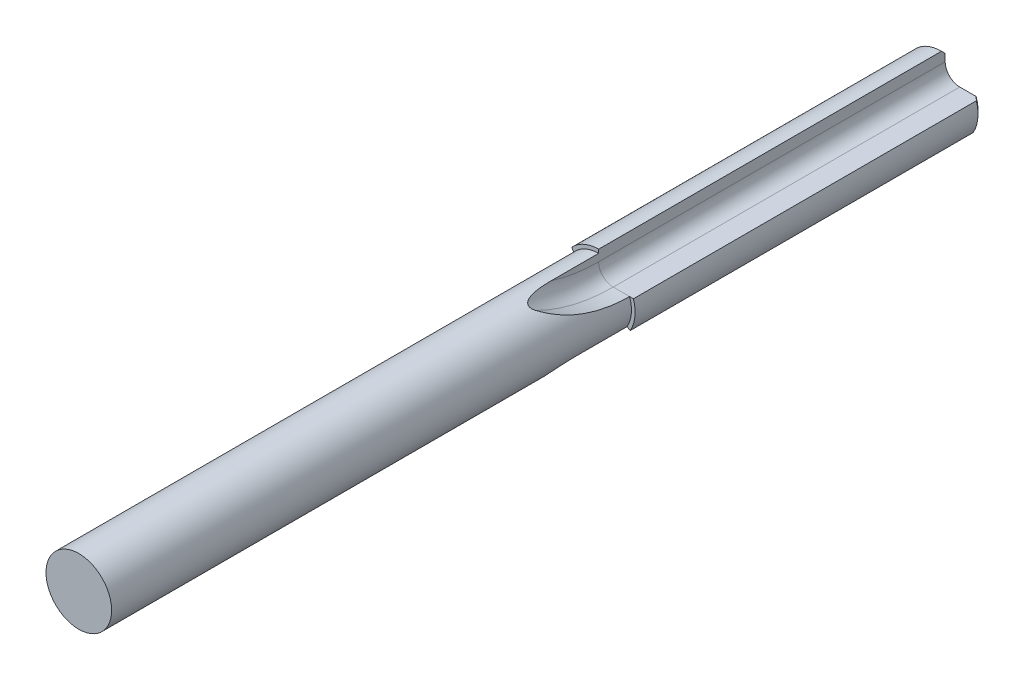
ISO-10303-21;
HEADER;
FILE_DESCRIPTION(('STEP AP214'),'2;1');
FILE_NAME('part.step','',(''),(''),'','','');
FILE_SCHEMA(('AUTOMOTIVE_DESIGN { 1 0 10303 214 1 1 1 1 }'));
ENDSEC;
DATA;
#1=APPLICATION_CONTEXT('core data for automotive mechanical design processes');
#2=APPLICATION_PROTOCOL_DEFINITION('international standard','automotive_design',2000,#1);
#3=PRODUCT_CONTEXT('',#1,'mechanical');
#4=PRODUCT('Part','Part','',(#3));
#5=PRODUCT_RELATED_PRODUCT_CATEGORY('part','',(#4));
#6=PRODUCT_DEFINITION_FORMATION('','',#4);
#7=PRODUCT_DEFINITION_CONTEXT('part definition',#1,'design');
#8=PRODUCT_DEFINITION('design','',#6,#7);
#9=PRODUCT_DEFINITION_SHAPE('','',#8);
#10=(LENGTH_UNIT() NAMED_UNIT(*) SI_UNIT(.MILLI.,.METRE.));
#11=(NAMED_UNIT(*) PLANE_ANGLE_UNIT() SI_UNIT($,.RADIAN.));
#12=(NAMED_UNIT(*) SI_UNIT($,.STERADIAN.) SOLID_ANGLE_UNIT());
#13=UNCERTAINTY_MEASURE_WITH_UNIT(LENGTH_MEASURE(1.E-05),#10,'distance_accuracy_value','');
#14=(GEOMETRIC_REPRESENTATION_CONTEXT(3) GLOBAL_UNCERTAINTY_ASSIGNED_CONTEXT((#13)) GLOBAL_UNIT_ASSIGNED_CONTEXT((#10,
#11,#12)) REPRESENTATION_CONTEXT('',''));
#15=CARTESIAN_POINT('',(0.,0.,0.));
#16=DIRECTION('',(0.,0.,1.));
#17=DIRECTION('',(1.,0.,0.));
#18=AXIS2_PLACEMENT_3D('',#15,#16,#17);
#19=CARTESIAN_POINT('',(0.,0.,11.6635805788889));
#20=DIRECTION('',(0.,0.,1.));
#21=DIRECTION('',(0.,-1.,0.));
#22=AXIS2_PLACEMENT_3D('',#19,#20,#21);
#23=CYLINDRICAL_SURFACE('',#22,0.449999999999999);
#24=CARTESIAN_POINT('',(0.,0.,11.875));
#25=DIRECTION('',(0.,0.,1.));
#26=DIRECTION('',(0.,-1.,0.));
#27=AXIS2_PLACEMENT_3D('',#24,#25,#26);
#28=CIRCLE('',#27,0.449999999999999);
#29=CARTESIAN_POINT('',(0.,-0.450000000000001,11.875));
#30=VERTEX_POINT('',#29);
#31=EDGE_CURVE('E324',#30,#30,#28,.T.);
#32=ORIENTED_EDGE('',*,*,#31,.F.);
#33=EDGE_LOOP('',(#32));
#34=FACE_BOUND('',#33,.T.);
#35=CARTESIAN_POINT('',(0.249106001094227,-0.374761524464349,5.81092621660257));
#36=CARTESIAN_POINT('',(0.236861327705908,-0.382880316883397,5.7980022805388));
#37=CARTESIAN_POINT('',(0.224907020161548,-0.389983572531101,5.78425280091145));
#38=CARTESIAN_POINT('',(0.201722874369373,-0.402472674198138,5.75552840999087));
#39=CARTESIAN_POINT('',(0.190490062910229,-0.407865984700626,5.74055919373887));
#40=CARTESIAN_POINT('',(0.168967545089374,-0.417234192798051,5.70996303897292));
#41=CARTESIAN_POINT('',(0.15866503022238,-0.421231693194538,5.69435165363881));
#42=CARTESIAN_POINT('',(0.138791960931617,-0.428191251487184,5.66242287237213));
#43=CARTESIAN_POINT('',(0.129222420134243,-0.431151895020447,5.64610454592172));
#44=CARTESIAN_POINT('',(0.105059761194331,-0.437840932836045,5.6025419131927));
#45=CARTESIAN_POINT('',(0.0910745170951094,-0.440888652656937,5.57485620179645));
#46=CARTESIAN_POINT('',(0.0649781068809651,-0.445478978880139,5.51851402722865));
#47=CARTESIAN_POINT('',(0.0528673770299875,-0.447021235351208,5.48985733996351));
#48=CARTESIAN_POINT('',(0.0188222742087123,-0.450199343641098,5.40194476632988));
#49=CARTESIAN_POINT('',(-0.000384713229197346,-0.450295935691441,5.34156881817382));
#50=CARTESIAN_POINT('',(-0.027897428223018,-0.449273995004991,5.23655461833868));
#51=CARTESIAN_POINT('',(-0.037749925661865,-0.448491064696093,5.19228945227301));
#52=CARTESIAN_POINT('',(-0.0544300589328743,-0.446775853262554,5.10316844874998));
#53=CARTESIAN_POINT('',(-0.0612563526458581,-0.445843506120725,5.05831235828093));
#54=CARTESIAN_POINT('',(-0.0718885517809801,-0.444253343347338,4.96959654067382));
#55=CARTESIAN_POINT('',(-0.0757781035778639,-0.443588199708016,4.92574676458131));
#56=CARTESIAN_POINT('',(-0.0809411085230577,-0.442661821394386,4.83793070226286));
#57=CARTESIAN_POINT('',(-0.0822170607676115,-0.442400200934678,4.79396456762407));
#58=CARTESIAN_POINT('',(-0.0822282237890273,-0.442423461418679,4.75000000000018));
#59=B_SPLINE_CURVE_WITH_KNOTS('',3,(#35,#36,#37,#38,#39,#40,#41,#42,#43,#44,#45,#46,#47,#48,#49,
#50,#51,#52,#53,#54,#55,#56,#57,#58),.UNSPECIFIED.,.F.,.F.,(4,2,2,2,2,2,2,2,2,2,2,4),(0.,
0.0585729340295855,0.116886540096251,0.174206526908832,0.231604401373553,0.324954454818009,
0.418326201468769,0.60785519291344,0.743835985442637,0.879877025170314,1.01187961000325,
1.14375591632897),.UNSPECIFIED.);
#60=CARTESIAN_POINT('',(0.249106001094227,-0.374761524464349,5.81092621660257));
#61=VERTEX_POINT('',#60);
#62=CARTESIAN_POINT('',(-0.0822282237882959,-0.442423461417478,4.75));
#63=VERTEX_POINT('',#62);
#64=EDGE_CURVE('E187',#61,#63,#59,.T.);
#65=ORIENTED_EDGE('',*,*,#64,.F.);
#66=CARTESIAN_POINT('',(0.37586699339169,-0.247434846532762,4.7498));
#67=CARTESIAN_POINT('',(0.375849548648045,-0.247458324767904,4.78317799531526));
#68=CARTESIAN_POINT('',(0.376113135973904,-0.247061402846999,4.81655101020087));
#69=CARTESIAN_POINT('',(0.377077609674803,-0.245588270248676,4.88326366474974));
#70=CARTESIAN_POINT('',(0.377778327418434,-0.244512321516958,4.91660331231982));
#71=CARTESIAN_POINT('',(0.37949266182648,-0.241842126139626,4.98325881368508));
#72=CARTESIAN_POINT('',(0.380506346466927,-0.240247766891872,5.01657466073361));
#73=CARTESIAN_POINT('',(0.382638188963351,-0.236837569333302,5.08319189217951));
#74=CARTESIAN_POINT('',(0.383756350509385,-0.235021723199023,5.11649327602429));
#75=CARTESIAN_POINT('',(0.385869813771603,-0.231535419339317,5.18310690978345));
#76=CARTESIAN_POINT('',(0.386865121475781,-0.229864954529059,5.21641915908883));
#77=CARTESIAN_POINT('',(0.388496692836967,-0.227096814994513,5.28308888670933));
#78=CARTESIAN_POINT('',(0.389132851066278,-0.22599930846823,5.31644637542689));
#79=CARTESIAN_POINT('',(0.389796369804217,-0.224854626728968,5.38328415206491));
#80=CARTESIAN_POINT('',(0.389822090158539,-0.224810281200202,5.41676452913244));
#81=CARTESIAN_POINT('',(0.38893577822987,-0.226339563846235,5.48365091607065));
#82=CARTESIAN_POINT('',(0.388024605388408,-0.227911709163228,5.51705696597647));
#83=CARTESIAN_POINT('',(0.384753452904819,-0.233406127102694,5.58403348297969));
#84=CARTESIAN_POINT('',(0.382377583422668,-0.237354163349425,5.61760169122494));
#85=CARTESIAN_POINT('',(0.376842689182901,-0.245966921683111,5.66717801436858));
#86=CARTESIAN_POINT('',(0.374678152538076,-0.249273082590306,5.68352863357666));
#87=CARTESIAN_POINT('',(0.36938942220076,-0.257050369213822,5.71578238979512));
#88=CARTESIAN_POINT('',(0.366267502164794,-0.261518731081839,5.73168649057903));
#89=CARTESIAN_POINT('',(0.360280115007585,-0.26964840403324,5.75546422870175));
#90=CARTESIAN_POINT('',(0.357956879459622,-0.272735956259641,5.76366757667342));
#91=CARTESIAN_POINT('',(0.352696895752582,-0.279506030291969,5.77963462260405));
#92=CARTESIAN_POINT('',(0.349760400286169,-0.283188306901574,5.78739849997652));
#93=CARTESIAN_POINT('',(0.344097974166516,-0.290016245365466,5.79980781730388));
#94=CARTESIAN_POINT('',(0.34159879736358,-0.292963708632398,5.80466334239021));
#95=CARTESIAN_POINT('',(0.336094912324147,-0.299261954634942,5.81379810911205));
#96=CARTESIAN_POINT('',(0.33309120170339,-0.302611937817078,5.81807845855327));
#97=CARTESIAN_POINT('',(0.327538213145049,-0.30859283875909,5.82450229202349));
#98=CARTESIAN_POINT('',(0.325152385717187,-0.311109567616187,5.82689073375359));
#99=CARTESIAN_POINT('',(0.320087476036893,-0.316318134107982,5.8311017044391));
#100=CARTESIAN_POINT('',(0.317408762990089,-0.319009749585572,5.83292493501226));
#101=CARTESIAN_POINT('',(0.311751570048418,-0.32454077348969,5.83587050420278));
#102=CARTESIAN_POINT('',(0.308770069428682,-0.327381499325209,5.83698476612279));
#103=CARTESIAN_POINT('',(0.30262429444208,-0.333070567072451,5.8383694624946));
#104=CARTESIAN_POINT('',(0.29946014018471,-0.335918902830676,5.83864044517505));
#105=CARTESIAN_POINT('',(0.293546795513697,-0.341091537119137,5.83837082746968));
#106=CARTESIAN_POINT('',(0.290804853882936,-0.343431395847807,5.83794349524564));
#107=CARTESIAN_POINT('',(0.285348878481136,-0.347977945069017,5.83655099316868));
#108=CARTESIAN_POINT('',(0.282634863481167,-0.35018455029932,5.83558548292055));
#109=CARTESIAN_POINT('',(0.275883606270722,-0.355549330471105,5.83258597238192));
#110=CARTESIAN_POINT('',(0.271895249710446,-0.358602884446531,5.83025730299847));
#111=CARTESIAN_POINT('',(0.264157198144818,-0.364340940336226,5.82486657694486));
#112=CARTESIAN_POINT('',(0.260408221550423,-0.367024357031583,5.82180243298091));
#113=CARTESIAN_POINT('',(0.250188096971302,-0.374126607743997,5.81246027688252));
#114=CARTESIAN_POINT('',(0.243995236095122,-0.378172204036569,5.80560176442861));
#115=CARTESIAN_POINT('',(0.232272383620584,-0.385482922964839,5.79097795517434));
#116=CARTESIAN_POINT('',(0.226744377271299,-0.388745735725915,5.78321007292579));
#117=CARTESIAN_POINT('',(0.21367962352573,-0.396133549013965,5.76324795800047));
#118=CARTESIAN_POINT('',(0.206458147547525,-0.399916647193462,5.75072414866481));
#119=CARTESIAN_POINT('',(0.192868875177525,-0.406642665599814,5.72499628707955));
#120=CARTESIAN_POINT('',(0.186502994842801,-0.409583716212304,5.71179079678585));
#121=CARTESIAN_POINT('',(0.168368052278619,-0.417527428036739,5.67143594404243));
#122=CARTESIAN_POINT('',(0.157623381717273,-0.421618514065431,5.64365331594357));
#123=CARTESIAN_POINT('',(0.131459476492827,-0.43071937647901,5.56839478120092));
#124=CARTESIAN_POINT('',(0.117742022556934,-0.434503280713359,5.52021486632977));
#125=CARTESIAN_POINT('',(0.0939780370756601,-0.440239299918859,5.42279117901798));
#126=CARTESIAN_POINT('',(0.0839404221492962,-0.44218698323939,5.37354512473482));
#127=CARTESIAN_POINT('',(0.0668154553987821,-0.44509688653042,5.27448271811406));
#128=CARTESIAN_POINT('',(0.0597305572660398,-0.446058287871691,5.22466592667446));
#129=CARTESIAN_POINT('',(0.0480324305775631,-0.447466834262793,5.12479548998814));
#130=CARTESIAN_POINT('',(0.0434167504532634,-0.447914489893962,5.07474212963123));
#131=CARTESIAN_POINT('',(0.036600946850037,-0.448521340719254,4.97875973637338));
#132=CARTESIAN_POINT('',(0.0342285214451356,-0.448701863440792,4.93284265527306));
#133=CARTESIAN_POINT('',(0.0311165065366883,-0.448922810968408,4.84121526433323));
#134=CARTESIAN_POINT('',(0.0303676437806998,-0.44896403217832,4.79550527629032));
#135=CARTESIAN_POINT('',(0.030350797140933,-0.44897531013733,4.7498));
#136=B_SPLINE_CURVE_WITH_KNOTS('',3,(#66,#67,#68,#69,#70,#71,#72,#73,#74,#75,#76,#77,#78,#79,
#80,#81,#82,#83,#84,#85,#86,#87,#88,#89,#90,#91,#92,#93,#94,#95,#96,#97,#98,#99,#100,#101,#102,
#103,#104,#105,#106,#107,#108,#109,#110,#111,#112,#113,#114,#115,#116,#117,#118,#119,#120,#121,
#122,#123,#124,#125,#126,#127,#128,#129,#130,#131,#132,#133,#134,#135),.UNSPECIFIED.,.F.,.F.,(4,
2,2,2,2,2,2,2,2,2,2,2,2,2,2,2,2,2,2,2,2,2,2,2,2,2,2,2,2,2,2,2,2,2,4),(0.,0.10012257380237,
0.200206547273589,0.300312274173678,0.400421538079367,0.500525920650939,0.600659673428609,
0.701062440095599,0.80137318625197,0.902791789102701,0.953214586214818,1.00351855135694,
1.03069035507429,1.05785098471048,1.07642777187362,1.09496825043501,1.10755952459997,
1.12013510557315,1.13285149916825,1.14555962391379,1.15640275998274,1.16725276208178,
1.18376707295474,1.20032881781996,1.23042102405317,1.26060096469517,1.30532032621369,
1.35013822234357,1.44014858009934,1.59056255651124,1.74133862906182,1.89223974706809,
2.04299076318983,2.18089761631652,2.31801469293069),.UNSPECIFIED.);
#137=CARTESIAN_POINT('',(0.389711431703,-0.224999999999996,5.39807406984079));
#138=VERTEX_POINT('',#137);
#139=EDGE_CURVE('E11',#138,#61,#136,.T.);
#140=ORIENTED_EDGE('',*,*,#139,.F.);
#141=DIRECTION('',(0.,0.,1.));
#142=VECTOR('',#141,1.);
#143=CARTESIAN_POINT('',(0.389711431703,-0.224999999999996,11.6635805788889));
#144=LINE('',#143,#142);
#145=CARTESIAN_POINT('',(0.389711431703,-0.224999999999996,4.75));
#146=VERTEX_POINT('',#145);
#147=EDGE_CURVE('E247',#138,#146,#144,.F.);
#148=ORIENTED_EDGE('',*,*,#147,.T.);
#149=CARTESIAN_POINT('',(0.,0.,4.75));
#150=DIRECTION('',(0.,0.,1.));
#151=DIRECTION('',(0.,-1.,0.));
#152=AXIS2_PLACEMENT_3D('',#149,#150,#151);
#153=CIRCLE('',#152,0.449999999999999);
#154=CARTESIAN_POINT('',(0.424264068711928,0.149999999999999,4.75));
#155=VERTEX_POINT('',#154);
#156=EDGE_CURVE('E329',#146,#155,#153,.T.);
#157=ORIENTED_EDGE('',*,*,#156,.T.);
#158=CARTESIAN_POINT('',(0.2,0.403112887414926,5.81092621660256));
#159=CARTESIAN_POINT('',(0.213153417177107,0.396568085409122,5.7980022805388));
#160=CARTESIAN_POINT('',(0.225282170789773,0.389766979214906,5.78425280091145));
#161=CARTESIAN_POINT('',(0.24769012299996,0.375933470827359,5.75552840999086));
#162=CARTESIAN_POINT('',(0.257977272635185,0.368902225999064,5.74055919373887));
#163=CARTESIAN_POINT('',(0.276851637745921,0.354947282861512,5.70996303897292));
#164=CARTESIAN_POINT('',(0.285464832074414,0.348023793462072,5.69435165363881));
#165=CARTESIAN_POINT('',(0.301428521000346,0.334292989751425,5.66242287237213));
#166=CARTESIAN_POINT('',(0.308777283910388,0.327485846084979,5.64610454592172));
#167=CARTESIAN_POINT('',(0.326651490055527,0.309904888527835,5.6025419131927));
#168=CARTESIAN_POINT('',(0.336283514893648,0.299317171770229,5.57485620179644));
#169=CARTESIAN_POINT('',(0.353307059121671,0.279012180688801,5.51851402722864));
#170=CARTESIAN_POINT('',(0.360698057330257,0.269295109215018,5.4898573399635));
#171=CARTESIAN_POINT('',(0.380472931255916,0.241400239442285,5.40194476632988));
#172=CARTESIAN_POINT('',(0.390160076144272,0.224814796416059,5.34156881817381));
#173=CARTESIAN_POINT('',(0.403031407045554,0.200477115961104,5.23655461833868));
#174=CARTESIAN_POINT('',(0.407279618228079,0.191553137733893,5.19228945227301));
#175=CARTESIAN_POINT('',(0.414134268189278,0.17625011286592,5.10316844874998));
#176=CARTESIAN_POINT('',(0.4167399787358,0.169872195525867,5.05831235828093));
#177=CARTESIAN_POINT('',(0.420678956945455,0.159869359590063,4.96959654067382));
#178=CARTESIAN_POINT('',(0.422047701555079,0.156168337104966,4.92574676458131));
#179=CARTESIAN_POINT('',(0.423826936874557,0.151233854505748,4.83793070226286));
#180=CARTESIAN_POINT('',(0.424238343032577,0.149998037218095,4.79396456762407));
#181=CARTESIAN_POINT('',(0.424264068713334,0.149999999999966,4.75000000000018));
#182=B_SPLINE_CURVE_WITH_KNOTS('',3,(#158,#159,#160,#161,#162,#163,#164,#165,#166,#167,#168,
#169,#170,#171,#172,#173,#174,#175,#176,#177,#178,#179,#180,#181),.UNSPECIFIED.,.F.,.F.,(4,2,2,
2,2,2,2,2,2,2,2,4),(0.,0.0585729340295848,0.116886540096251,0.174206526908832,0.231604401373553,
0.324954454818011,0.418326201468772,0.607855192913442,0.743835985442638,0.879877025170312,
1.01187961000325,1.14375591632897),.UNSPECIFIED.);
#183=CARTESIAN_POINT('',(0.2,0.403112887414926,5.81092621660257));
#184=VERTEX_POINT('',#183);
#185=EDGE_CURVE('E270',#184,#155,#182,.T.);
#186=ORIENTED_EDGE('',*,*,#185,.F.);
#187=CARTESIAN_POINT('',(0.0263513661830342,0.44922778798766,4.7498));
#188=CARTESIAN_POINT('',(0.0263802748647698,0.449224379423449,4.78314810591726));
#189=CARTESIAN_POINT('',(0.0259056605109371,0.449254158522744,4.81649123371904));
#190=CARTESIAN_POINT('',(0.0241508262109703,0.44935273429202,4.88314249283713));
#191=CARTESIAN_POINT('',(0.0228709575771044,0.449421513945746,4.91645063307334));
#192=CARTESIAN_POINT('',(0.0197034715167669,0.449570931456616,4.98310453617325));
#193=CARTESIAN_POINT('',(0.0178146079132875,0.44965159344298,5.0164502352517));
#194=CARTESIAN_POINT('',(0.0137924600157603,0.449793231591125,5.08312874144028));
#195=CARTESIAN_POINT('',(0.0116591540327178,0.449854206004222,5.11646154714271));
#196=CARTESIAN_POINT('',(0.00640610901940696,0.449964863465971,5.20228689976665));
#197=CARTESIAN_POINT('',(0.00342346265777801,0.449987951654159,5.25478913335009));
#198=CARTESIAN_POINT('',(-0.000135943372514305,0.450006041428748,5.35985775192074));
#199=CARTESIAN_POINT('',(-0.000715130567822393,0.450001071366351,5.41242401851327));
#200=CARTESIAN_POINT('',(0.0024123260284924,0.449996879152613,5.50214751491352));
#201=CARTESIAN_POINT('',(0.00491878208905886,0.449996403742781,5.53932948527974));
#202=CARTESIAN_POINT('',(0.0115311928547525,0.449856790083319,5.59482292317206));
#203=CARTESIAN_POINT('',(0.0142168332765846,0.449786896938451,5.61330107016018));
#204=CARTESIAN_POINT('',(0.0208298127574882,0.449530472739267,5.65002798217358));
#205=CARTESIAN_POINT('',(0.0247558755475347,0.449344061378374,5.6682769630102));
#206=CARTESIAN_POINT('',(0.034332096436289,0.448714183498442,5.7044931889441));
#207=CARTESIAN_POINT('',(0.0399980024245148,0.448268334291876,5.72245621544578));
#208=CARTESIAN_POINT('',(0.0538300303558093,0.44682732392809,5.75737325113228));
#209=CARTESIAN_POINT('',(0.0619770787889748,0.445836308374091,5.77433381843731));
#210=CARTESIAN_POINT('',(0.0759040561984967,0.443566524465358,5.79544632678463));
#211=CARTESIAN_POINT('',(0.0798547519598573,0.44287921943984,5.80084082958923));
#212=CARTESIAN_POINT('',(0.0884363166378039,0.441246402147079,5.81101861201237));
#213=CARTESIAN_POINT('',(0.0930654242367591,0.440301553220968,5.81580341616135));
#214=CARTESIAN_POINT('',(0.101281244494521,0.438466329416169,5.8228267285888));
#215=CARTESIAN_POINT('',(0.10463731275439,0.43768042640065,5.82535942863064));
#216=CARTESIAN_POINT('',(0.111665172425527,0.435940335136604,5.82987534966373));
#217=CARTESIAN_POINT('',(0.115336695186,0.434986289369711,5.83185903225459));
#218=CARTESIAN_POINT('',(0.122988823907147,0.432885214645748,5.83513506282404));
#219=CARTESIAN_POINT('',(0.126972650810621,0.431735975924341,5.83641869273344));
#220=CARTESIAN_POINT('',(0.135070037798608,0.429271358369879,5.83812393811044));
#221=CARTESIAN_POINT('',(0.139183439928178,0.427956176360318,5.8385465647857));
#222=CARTESIAN_POINT('',(0.146731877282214,0.425421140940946,5.83852210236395));
#223=CARTESIAN_POINT('',(0.150173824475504,0.424217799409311,5.83819893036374));
#224=CARTESIAN_POINT('',(0.156938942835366,0.421761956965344,5.8369909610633));
#225=CARTESIAN_POINT('',(0.16026201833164,0.420509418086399,5.83610572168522));
#226=CARTESIAN_POINT('',(0.168225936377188,0.417403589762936,5.83334679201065));
#227=CARTESIAN_POINT('',(0.172768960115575,0.415539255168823,5.83120564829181));
#228=CARTESIAN_POINT('',(0.181445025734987,0.411825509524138,5.82620221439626));
#229=CARTESIAN_POINT('',(0.185576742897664,0.409976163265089,5.8233376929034));
#230=CARTESIAN_POINT('',(0.193244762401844,0.406414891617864,5.81725652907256));
#231=CARTESIAN_POINT('',(0.196800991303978,0.404700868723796,5.81406649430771));
#232=CARTESIAN_POINT('',(0.200200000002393,0.403013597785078,5.81072972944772));
#233=B_SPLINE_CURVE_WITH_KNOTS('',3,(#187,#188,#189,#190,#191,#192,#193,#194,#195,#196,#197,
#198,#199,#200,#201,#202,#203,#204,#205,#206,#207,#208,#209,#210,#211,#212,#213,#214,#215,#216,
#217,#218,#219,#220,#221,#222,#223,#224,#225,#226,#227,#228,#229,#230,#231,#232),.UNSPECIFIED.,
.F.,.F.,(4,2,2,2,2,2,2,2,2,2,2,2,2,2,2,2,2,2,2,2,2,2,4),(0.,0.100032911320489,0.200022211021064,
0.300217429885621,0.400421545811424,0.558172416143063,0.715763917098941,0.827414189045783,
0.883403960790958,0.93933631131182,0.995790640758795,1.05182149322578,1.07194288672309,
1.09201293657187,1.10480569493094,1.1175876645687,1.13052537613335,1.14344788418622,
1.15438025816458,1.16532124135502,1.18130028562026,1.19732923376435,1.21251112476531),.UNSPECIFIED.);
#234=CARTESIAN_POINT('',(0.,0.449999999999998,5.39807406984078));
#235=VERTEX_POINT('',#234);
#236=EDGE_CURVE('E262',#235,#184,#233,.T.);
#237=ORIENTED_EDGE('',*,*,#236,.F.);
#238=DIRECTION('',(0.,0.,1.));
#239=VECTOR('',#238,1.);
#240=CARTESIAN_POINT('',(0.,0.449999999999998,11.6635805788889));
#241=LINE('',#240,#239);
#242=CARTESIAN_POINT('',(0.,0.449999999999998,4.75));
#243=VERTEX_POINT('',#242);
#244=EDGE_CURVE('E347',#235,#243,#241,.F.);
#245=ORIENTED_EDGE('',*,*,#244,.T.);
#246=CARTESIAN_POINT('',(-0.34203584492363,0.292423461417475,4.75));
#247=VERTEX_POINT('',#246);
#248=EDGE_CURVE('E330',#243,#247,#153,.T.);
#249=ORIENTED_EDGE('',*,*,#248,.T.);
#250=CARTESIAN_POINT('',(-0.449106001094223,-0.0283513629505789,5.81092621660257));
#251=CARTESIAN_POINT('',(-0.450014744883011,-0.0136877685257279,5.7980022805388));
#252=CARTESIAN_POINT('',(-0.450189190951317,0.000216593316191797,5.78425280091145));
#253=CARTESIAN_POINT('',(-0.44941299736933,0.0265392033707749,5.75552840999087));
#254=CARTESIAN_POINT('',(-0.448467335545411,0.0389637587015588,5.74055919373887));
#255=CARTESIAN_POINT('',(-0.445819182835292,0.0622869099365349,5.70996303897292));
#256=CARTESIAN_POINT('',(-0.444129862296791,0.0732078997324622,5.69435165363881));
#257=CARTESIAN_POINT('',(-0.440220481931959,0.0938982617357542,5.66242287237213));
#258=CARTESIAN_POINT('',(-0.437999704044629,0.103666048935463,5.64610454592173));
#259=CARTESIAN_POINT('',(-0.431711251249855,0.127936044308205,5.6025419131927));
#260=CARTESIAN_POINT('',(-0.427358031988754,0.141571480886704,5.57485620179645));
#261=CARTESIAN_POINT('',(-0.418285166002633,0.166466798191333,5.51851402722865));
#262=CARTESIAN_POINT('',(-0.413565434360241,0.177726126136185,5.48985733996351));
#263=CARTESIAN_POINT('',(-0.399295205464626,0.208799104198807,5.40194476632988));
#264=CARTESIAN_POINT('',(-0.389775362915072,0.225481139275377,5.34156881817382));
#265=CARTESIAN_POINT('',(-0.375133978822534,0.248796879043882,5.23655461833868));
#266=CARTESIAN_POINT('',(-0.369529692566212,0.256937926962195,5.19228945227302));
#267=CARTESIAN_POINT('',(-0.359704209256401,0.27052574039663,5.10316844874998));
#268=CARTESIAN_POINT('',(-0.35548362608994,0.275971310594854,5.05831235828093));
#269=CARTESIAN_POINT('',(-0.348790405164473,0.284383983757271,4.96959654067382));
#270=CARTESIAN_POINT('',(-0.346269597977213,0.287419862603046,4.92574676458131));
#271=CARTESIAN_POINT('',(-0.342885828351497,0.291427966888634,4.83793070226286));
#272=CARTESIAN_POINT('',(-0.342021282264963,0.292402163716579,4.79396456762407));
#273=CARTESIAN_POINT('',(-0.342035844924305,0.292423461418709,4.75000000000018));
#274=B_SPLINE_CURVE_WITH_KNOTS('',3,(#250,#251,#252,#253,#254,#255,#256,#257,#258,#259,#260,
#261,#262,#263,#264,#265,#266,#267,#268,#269,#270,#271,#272,#273),.UNSPECIFIED.,.F.,.F.,(4,2,2,
2,2,2,2,2,2,2,2,4),(0.,0.0585729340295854,0.116886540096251,0.174206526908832,0.231604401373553,
0.324954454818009,0.418326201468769,0.60785519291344,0.743835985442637,0.879877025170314,
1.01187961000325,1.14375591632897),.UNSPECIFIED.);
#275=CARTESIAN_POINT('',(-0.449106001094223,-0.028351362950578,5.81092621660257));
#276=VERTEX_POINT('',#275);
#277=EDGE_CURVE('E278',#276,#247,#274,.T.);
#278=ORIENTED_EDGE('',*,*,#277,.F.);
#279=CARTESIAN_POINT('',(-0.402218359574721,-0.201792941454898,4.7498));
#280=CARTESIAN_POINT('',(-0.402229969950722,-0.201766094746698,4.78317799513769));
#281=CARTESIAN_POINT('',(-0.402018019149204,-0.20219282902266,4.81655100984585));
#282=CARTESIAN_POINT('',(-0.401224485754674,-0.203764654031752,4.88326366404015));
#283=CARTESIAN_POINT('',(-0.400643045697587,-0.204909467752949,4.9166033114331));
#284=CARTESIAN_POINT('',(-0.399187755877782,-0.207729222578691,4.9832588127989));
#285=CARTESIAN_POINT('',(-0.398313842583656,-0.209404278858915,5.01657466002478));
#286=CARTESIAN_POINT('',(-0.396426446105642,-0.21295560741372,5.08319189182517));
#287=CARTESIAN_POINT('',(-0.395412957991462,-0.214831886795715,5.11649327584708));
#288=CARTESIAN_POINT('',(-0.393450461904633,-0.218405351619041,5.18310690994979));
#289=CARTESIAN_POINT('',(-0.392501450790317,-0.220102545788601,5.21641915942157));
#290=CARTESIAN_POINT('',(-0.39091995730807,-0.22289959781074,5.28308888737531));
#291=CARTESIAN_POINT('',(-0.390287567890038,-0.223999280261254,5.31644637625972));
#292=CARTESIAN_POINT('',(-0.389628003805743,-0.225146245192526,5.38328415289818));
#293=CARTESIAN_POINT('',(-0.389602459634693,-0.225190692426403,5.41676452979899));
#294=CARTESIAN_POINT('',(-0.390483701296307,-0.223658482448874,5.48365091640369));
#295=CARTESIAN_POINT('',(-0.39138963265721,-0.222083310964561,5.51705696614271));
#296=CARTESIAN_POINT('',(-0.394512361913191,-0.216503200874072,5.58403348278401));
#297=CARTESIAN_POINT('',(-0.39674352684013,-0.212471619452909,5.6176016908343));
#298=CARTESIAN_POINT('',(-0.401434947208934,-0.203371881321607,5.66717801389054));
#299=CARTESIAN_POINT('',(-0.403215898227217,-0.199844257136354,5.68352863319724));
#300=CARTESIAN_POINT('',(-0.407306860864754,-0.191375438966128,5.71578238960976));
#301=CARTESIAN_POINT('',(-0.409615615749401,-0.186437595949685,5.73168649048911));
#302=CARTESIAN_POINT('',(-0.413662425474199,-0.177187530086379,5.7554642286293));
#303=CARTESIAN_POINT('',(-0.415174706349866,-0.173631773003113,5.76366757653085));
#304=CARTESIAN_POINT('',(-0.418407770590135,-0.165691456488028,5.77963462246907));
#305=CARTESIAN_POINT('',(-0.420128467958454,-0.161307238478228,5.78739849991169));
#306=CARTESIAN_POINT('',(-0.42321042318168,-0.152989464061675,5.79980781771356));
#307=CARTESIAN_POINT('',(-0.424513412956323,-0.149351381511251,5.80466334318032));
#308=CARTESIAN_POINT('',(-0.427215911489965,-0.141435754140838,5.81379810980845));
#309=CARTESIAN_POINT('',(-0.428615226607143,-0.137159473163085,5.81807845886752));
#310=CARTESIAN_POINT('',(-0.431018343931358,-0.129359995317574,5.82450229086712));
#311=CARTESIAN_POINT('',(-0.432004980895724,-0.126035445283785,5.82689073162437));
#312=CARTESIAN_POINT('',(-0.433983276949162,-0.11904482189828,5.83110170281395));
#313=CARTESIAN_POINT('',(-0.434974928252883,-0.115379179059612,5.83292493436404));
#314=CARTESIAN_POINT('',(-0.436936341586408,-0.107714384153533,5.83587050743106));
#315=CARTESIAN_POINT('',(-0.437905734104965,-0.103711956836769,5.83698477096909));
#316=CARTESIAN_POINT('',(-0.439759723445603,-0.095545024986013,5.83836946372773));
#317=CARTESIAN_POINT('',(-0.440644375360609,-0.0913806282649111,5.8386404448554));
#318=CARTESIAN_POINT('',(-0.442167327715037,-0.0836732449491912,5.83837082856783));
#319=CARTESIAN_POINT('',(-0.442822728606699,-0.0801287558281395,5.8379435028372));
#320=CARTESIAN_POINT('',(-0.444032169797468,-0.0731304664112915,5.83655101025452));
#321=CARTESIAN_POINT('',(-0.444586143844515,-0.0696767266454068,5.83558549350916));
#322=CARTESIAN_POINT('',(-0.445856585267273,-0.0611473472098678,5.83258590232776));
#323=CARTESIAN_POINT('',(-0.446506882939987,-0.0561663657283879,5.83025712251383));
#324=CARTESIAN_POINT('',(-0.447607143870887,-0.0465960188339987,5.82486634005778));
#325=CARTESIAN_POINT('',(-0.448056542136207,-0.0420077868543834,5.82180230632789));
#326=CARTESIAN_POINT('',(-0.449097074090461,-0.0296073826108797,5.81246135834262));
#327=CARTESIAN_POINT('',(-0.449504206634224,-0.0222226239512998,5.80560421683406));
#328=CARTESIAN_POINT('',(-0.449974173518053,-0.00841464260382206,5.79098076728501));
#329=CARTESIAN_POINT('',(-0.450035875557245,-0.00199464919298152,5.78321155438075));
#330=CARTESIAN_POINT('',(-0.44990145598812,0.0130238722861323,5.76323590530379));
#331=CARTESIAN_POINT('',(-0.44956641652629,0.0211769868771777,5.75069871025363));
#332=CARTESIAN_POINT('',(-0.448595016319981,0.0363211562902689,5.7249438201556));
#333=CARTESIAN_POINT('',(-0.447957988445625,0.0433095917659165,5.71172467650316));
#334=CARTESIAN_POINT('',(-0.445769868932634,0.0629773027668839,5.67137782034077));
#335=CARTESIAN_POINT('',(-0.443943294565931,0.0743233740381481,5.64361457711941));
#336=CARTESIAN_POINT('',(-0.441526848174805,0.086946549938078,5.6086791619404));
#337=CARTESIAN_POINT('',(-0.441049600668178,0.0893342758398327,5.60185858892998));
#338=CARTESIAN_POINT('',(-0.440085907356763,0.0939693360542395,5.58820618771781));
#339=CARTESIAN_POINT('',(-0.439599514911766,0.0962172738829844,5.58137456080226));
#340=CARTESIAN_POINT('',(-0.439108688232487,0.098405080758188,5.57452172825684));
#341=B_SPLINE_CURVE_WITH_KNOTS('',3,(#279,#280,#281,#282,#283,#284,#285,#286,#287,#288,#289,
#290,#291,#292,#293,#294,#295,#296,#297,#298,#299,#300,#301,#302,#303,#304,#305,#306,#307,#308,
#309,#310,#311,#312,#313,#314,#315,#316,#317,#318,#319,#320,#321,#322,#323,#324,#325,#326,#327,
#328,#329,#330,#331,#332,#333,#334,#335,#336,#337,#338,#339,#340),.UNSPECIFIED.,.F.,.F.,(4,2,2,
2,2,2,2,2,2,2,2,2,2,2,2,2,2,2,2,2,2,2,2,2,2,2,2,2,2,2,4),(0.,0.10012257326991,0.200206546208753,
0.30031227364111,0.400421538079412,0.500525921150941,0.60065967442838,0.701062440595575,
0.801373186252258,0.902791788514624,0.9532145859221,1.00351855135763,1.03069035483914,
1.057850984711,1.07642777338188,1.09496825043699,1.10755951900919,1.12013510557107,
1.13285152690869,1.1455596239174,1.15640266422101,1.16725276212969,1.1837677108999,
1.20032881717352,1.23041561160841,1.26060097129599,1.30536534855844,1.35022908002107,
1.44014864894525,1.46187627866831,1.48350244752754),.UNSPECIFIED.);
#342=CARTESIAN_POINT('',(-0.389711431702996,-0.225000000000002,5.39807406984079));
#343=VERTEX_POINT('',#342);
#344=EDGE_CURVE('E286',#343,#276,#341,.T.);
#345=ORIENTED_EDGE('',*,*,#344,.F.);
#346=DIRECTION('',(0.,0.,1.));
#347=VECTOR('',#346,1.);
#348=CARTESIAN_POINT('',(-0.389711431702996,-0.225000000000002,11.6635805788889));
#349=LINE('',#348,#347);
#350=CARTESIAN_POINT('',(-0.389711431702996,-0.225000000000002,4.75));
#351=VERTEX_POINT('',#350);
#352=EDGE_CURVE('E437',#343,#351,#349,.F.);
#353=ORIENTED_EDGE('',*,*,#352,.T.);
#354=EDGE_CURVE('E334',#351,#63,#153,.T.);
#355=ORIENTED_EDGE('',*,*,#354,.T.);
#356=EDGE_LOOP('',(#65,#140,#148,#157,#186,#237,#245,#249,#278,#345,#353,#355));
#357=FACE_BOUND('',#356,.T.);
#358=ADVANCED_FACE('F35',(#34,#357),#23,.T.);
#359=CARTESIAN_POINT('',(0.,0.,0.));
#360=DIRECTION('',(0.,0.,1.));
#361=DIRECTION('',(0.,-1.,0.));
#362=AXIS2_PLACEMENT_3D('',#359,#360,#361);
#363=CONICAL_SURFACE('',#362,0.450000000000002,0.785398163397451);
#364=CARTESIAN_POINT('',(0.,0.,0.0499999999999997));
#365=DIRECTION('',(0.,0.,1.));
#366=DIRECTION('',(0.,-1.,0.));
#367=AXIS2_PLACEMENT_3D('',#364,#365,#366);
#368=CIRCLE('',#367,0.500000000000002);
#369=CARTESIAN_POINT('',(0.433012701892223,-0.249999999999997,0.0499999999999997));
#370=VERTEX_POINT('',#369);
#371=CARTESIAN_POINT('',(0.476969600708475,0.149999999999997,0.0499999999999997));
#372=VERTEX_POINT('',#371);
#373=EDGE_CURVE('E338',#370,#372,#368,.T.);
#374=ORIENTED_EDGE('',*,*,#373,.F.);
#375=DIRECTION('',(-0.6123724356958,0.353553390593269,-0.707106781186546));
#376=VECTOR('',#375,1.);
#377=CARTESIAN_POINT('',(0.,0.,-0.449999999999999));
#378=LINE('',#377,#376);
#379=CARTESIAN_POINT('',(0.389711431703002,-0.224999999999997,0.));
#380=VERTEX_POINT('',#379);
#381=EDGE_CURVE('E509',#370,#380,#378,.T.);
#382=ORIENTED_EDGE('',*,*,#381,.T.);
#383=CARTESIAN_POINT('',(0.,0.,0.));
#384=DIRECTION('',(0.,0.,1.));
#385=DIRECTION('',(0.,-1.,0.));
#386=AXIS2_PLACEMENT_3D('',#383,#384,#385);
#387=CIRCLE('',#386,0.450000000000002);
#388=CARTESIAN_POINT('',(0.42426406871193,0.15,0.));
#389=VERTEX_POINT('',#388);
#390=EDGE_CURVE('E343',#380,#389,#387,.T.);
#391=ORIENTED_EDGE('',*,*,#390,.T.);
#392=CARTESIAN_POINT('',(0.27468989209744,0.15,-0.137023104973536));
#393=CARTESIAN_POINT('',(0.298844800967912,0.15,-0.115767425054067));
#394=CARTESIAN_POINT('',(0.322736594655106,0.15,-0.0942203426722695));
#395=CARTESIAN_POINT('',(0.370154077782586,0.15,-0.0507316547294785));
#396=CARTESIAN_POINT('',(0.393679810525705,0.15,-0.0287900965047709));
#397=CARTESIAN_POINT('',(0.451115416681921,0.15,0.0252660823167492));
#398=CARTESIAN_POINT('',(0.484914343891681,0.15,0.0574977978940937));
#399=CARTESIAN_POINT('',(0.552276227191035,0.15,0.122207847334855));
#400=CARTESIAN_POINT('',(0.585839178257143,0.15,0.154686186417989));
#401=CARTESIAN_POINT('',(0.652834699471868,0.15,0.21979919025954));
#402=CARTESIAN_POINT('',(0.686267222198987,0.15,0.252433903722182));
#403=CARTESIAN_POINT('',(0.753033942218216,0.15,0.317800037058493));
#404=CARTESIAN_POINT('',(0.786368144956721,0.15,0.350531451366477));
#405=CARTESIAN_POINT('',(0.819676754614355,0.15,0.383288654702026));
#406=B_SPLINE_CURVE_WITH_KNOTS('',3,(#392,#393,#394,#395,#396,#397,#398,#399,#400,#401,#402,
#403,#404,#405),.UNSPECIFIED.,.F.,.F.,(4,2,2,2,2,2,4),(0.,0.0965170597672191,0.193022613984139,
0.333132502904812,0.473245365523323,0.613405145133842,0.753557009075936),.UNSPECIFIED.);
#407=EDGE_CURVE('E317',#389,#372,#406,.T.);
#408=ORIENTED_EDGE('',*,*,#407,.T.);
#409=EDGE_LOOP('',(#374,#382,#391,#408));
#410=FACE_BOUND('',#409,.T.);
#411=ADVANCED_FACE('F254',(#410),#363,.T.);
#412=CARTESIAN_POINT('',(0.,0.,11.6635805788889));
#413=DIRECTION('',(0.,0.,1.));
#414=DIRECTION('',(0.,-1.,0.));
#415=AXIS2_PLACEMENT_3D('',#412,#413,#414);
#416=CYLINDRICAL_SURFACE('',#415,0.500000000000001);
#417=CARTESIAN_POINT('',(0.,0.,4.75));
#418=DIRECTION('',(0.,0.,1.));
#419=DIRECTION('',(0.,-1.,0.));
#420=AXIS2_PLACEMENT_3D('',#417,#418,#419);
#421=CIRCLE('',#420,0.500000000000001);
#422=CARTESIAN_POINT('',(0.433012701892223,-0.249999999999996,4.75));
#423=VERTEX_POINT('',#422);
#424=CARTESIAN_POINT('',(0.476969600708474,0.149999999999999,4.75));
#425=VERTEX_POINT('',#424);
#426=EDGE_CURVE('E333',#423,#425,#421,.T.);
#427=ORIENTED_EDGE('',*,*,#426,.F.);
#428=DIRECTION('',(0.,0.,1.));
#429=VECTOR('',#428,1.);
#430=CARTESIAN_POINT('',(0.433012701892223,-0.249999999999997,11.6635805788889));
#431=LINE('',#430,#429);
#432=EDGE_CURVE('E511',#423,#370,#431,.F.);
#433=ORIENTED_EDGE('',*,*,#432,.T.);
#434=ORIENTED_EDGE('',*,*,#373,.T.);
#435=DIRECTION('',(0.,0.,1.));
#436=VECTOR('',#435,1.);
#437=CARTESIAN_POINT('',(0.476969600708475,0.149999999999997,11.6635805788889));
#438=LINE('',#437,#436);
#439=EDGE_CURVE('E325',#372,#425,#438,.T.);
#440=ORIENTED_EDGE('',*,*,#439,.T.);
#441=EDGE_LOOP('',(#427,#433,#434,#440));
#442=FACE_BOUND('',#441,.T.);
#443=ADVANCED_FACE('F395',(#442),#416,.T.);
#444=CARTESIAN_POINT('',(0.,0.449999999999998,4.75));
#445=DIRECTION('',(0.,0.,-1.));
#446=DIRECTION('',(0.,1.,0.));
#447=AXIS2_PLACEMENT_3D('',#444,#445,#446);
#448=PLANE('',#447);
#449=ORIENTED_EDGE('',*,*,#156,.F.);
#450=DIRECTION('',(0.866025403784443,-0.499999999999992,0.));
#451=VECTOR('',#450,1.);
#452=CARTESIAN_POINT('',(-0.194855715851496,0.112499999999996,4.75));
#453=LINE('',#452,#451);
#454=EDGE_CURVE('E225',#146,#423,#453,.T.);
#455=ORIENTED_EDGE('',*,*,#454,.T.);
#456=ORIENTED_EDGE('',*,*,#426,.T.);
#457=DIRECTION('',(-1.,0.,0.));
#458=VECTOR('',#457,1.);
#459=CARTESIAN_POINT('',(0.2,0.149999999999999,4.75));
#460=LINE('',#459,#458);
#461=EDGE_CURVE('E386',#425,#155,#460,.T.);
#462=ORIENTED_EDGE('',*,*,#461,.T.);
#463=EDGE_LOOP('',(#449,#455,#456,#462));
#464=FACE_BOUND('',#463,.T.);
#465=ADVANCED_FACE('F385',(#464),#448,.F.);
#466=CARTESIAN_POINT('',(-0.389711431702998,-0.225000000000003,0.));
#467=VERTEX_POINT('',#466);
#468=CARTESIAN_POINT('',(-0.0822282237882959,-0.44242346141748,0.));
#469=VERTEX_POINT('',#468);
#470=EDGE_CURVE('E348',#467,#469,#387,.T.);
#471=ORIENTED_EDGE('',*,*,#470,.T.);
#472=CARTESIAN_POINT('',(0.213385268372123,0.0695941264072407,-0.225552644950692));
#473=CARTESIAN_POINT('',(0.209089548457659,0.0621537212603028,-0.231926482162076));
#474=CARTESIAN_POINT('',(0.204745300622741,0.0546292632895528,-0.238184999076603));
#475=CARTESIAN_POINT('',(0.195870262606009,0.0392572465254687,-0.250345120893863));
#476=CARTESIAN_POINT('',(0.191338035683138,0.0314071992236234,-0.256242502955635));
#477=CARTESIAN_POINT('',(0.181817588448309,0.0149173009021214,-0.267737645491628));
#478=CARTESIAN_POINT('',(0.176818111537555,0.00625795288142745,-0.273299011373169));
#479=CARTESIAN_POINT('',(0.166559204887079,-0.0115109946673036,-0.283283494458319));
#480=CARTESIAN_POINT('',(0.161301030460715,-0.0206184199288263,-0.287711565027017));
#481=CARTESIAN_POINT('',(0.150815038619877,-0.0387806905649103,-0.294571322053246));
#482=CARTESIAN_POINT('',(0.145605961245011,-0.0478030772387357,-0.297110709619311));
#483=CARTESIAN_POINT('',(0.135124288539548,-0.065957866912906,-0.299985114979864));
#484=CARTESIAN_POINT('',(0.129854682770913,-0.0750850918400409,-0.300360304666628));
#485=CARTESIAN_POINT('',(0.119385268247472,-0.0932186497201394,-0.298896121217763));
#486=CARTESIAN_POINT('',(0.114185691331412,-0.102224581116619,-0.297050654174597));
#487=CARTESIAN_POINT('',(0.103977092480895,-0.119906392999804,-0.291602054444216));
#488=CARTESIAN_POINT('',(0.0989708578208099,-0.128577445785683,-0.28797946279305));
#489=CARTESIAN_POINT('',(0.0875509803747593,-0.148357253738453,-0.278143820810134));
#490=CARTESIAN_POINT('',(0.0812409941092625,-0.159286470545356,-0.271468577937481));
#491=CARTESIAN_POINT('',(0.0689543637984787,-0.180567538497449,-0.256967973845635));
#492=CARTESIAN_POINT('',(0.0629786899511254,-0.190917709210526,-0.249139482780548));
#493=CARTESIAN_POINT('',(0.0511981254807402,-0.211322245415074,-0.23272976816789));
#494=CARTESIAN_POINT('',(0.045395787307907,-0.221372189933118,-0.224141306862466));
#495=CARTESIAN_POINT('',(0.0339636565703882,-0.241173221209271,-0.206554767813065));
#496=CARTESIAN_POINT('',(0.0283336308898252,-0.250924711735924,-0.1975572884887));
#497=CARTESIAN_POINT('',(0.00896827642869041,-0.284466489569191,-0.165842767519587));
#498=CARTESIAN_POINT('',(-0.00448636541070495,-0.307770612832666,-0.142445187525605));
#499=CARTESIAN_POINT('',(-0.0310942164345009,-0.353856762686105,-0.0949714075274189));
#500=CARTESIAN_POINT('',(-0.0442473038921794,-0.376638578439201,-0.0708949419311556));
#501=CARTESIAN_POINT('',(-0.0704048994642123,-0.421944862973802,-0.0223333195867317));
#502=CARTESIAN_POINT('',(-0.0834091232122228,-0.44446883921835,0.00215245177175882));
#503=CARTESIAN_POINT('',(-0.109313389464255,-0.489336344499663,0.0513327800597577));
#504=CARTESIAN_POINT('',(-0.122213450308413,-0.511679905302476,0.0760272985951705));
#505=CARTESIAN_POINT('',(-0.15808354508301,-0.573808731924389,0.145052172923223));
#506=CARTESIAN_POINT('',(-0.180982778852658,-0.613471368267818,0.189529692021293));
#507=CARTESIAN_POINT('',(-0.215224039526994,-0.672778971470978,0.256349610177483));
#508=CARTESIAN_POINT('',(-0.226605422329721,-0.692492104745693,0.278611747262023));
#509=CARTESIAN_POINT('',(-0.249346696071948,-0.731881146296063,0.323177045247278));
#510=CARTESIAN_POINT('',(-0.260706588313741,-0.751557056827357,0.345480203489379));
#511=CARTESIAN_POINT('',(-0.272058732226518,-0.77121954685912,0.367799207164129));
#512=B_SPLINE_CURVE_WITH_KNOTS('',3,(#472,#473,#474,#475,#476,#477,#478,#479,#480,#481,#482,
#483,#484,#485,#486,#487,#488,#489,#490,#491,#492,#493,#494,#495,#496,#497,#498,#499,#500,#501,
#502,#503,#504,#505,#506,#507,#508,#509,#510,#511),.UNSPECIFIED.,.F.,.F.,(4,2,2,2,2,2,2,2,2,2,2,
2,2,2,2,2,2,2,2,4),(0.,0.032105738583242,0.0645343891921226,0.0988166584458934,
0.132946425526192,0.164937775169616,0.196333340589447,0.227815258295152,0.259649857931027,
0.302363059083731,0.34519439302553,0.388489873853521,0.431723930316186,0.538662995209,
0.64564449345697,0.75280440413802,0.85994501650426,1.05146775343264,1.14698592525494,
1.24249811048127),.UNSPECIFIED.);
#513=CARTESIAN_POINT('',(-0.10858098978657,-0.48806779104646,0.0499999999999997));
#514=VERTEX_POINT('',#513);
#515=EDGE_CURVE('E55',#469,#514,#512,.T.);
#516=ORIENTED_EDGE('',*,*,#515,.T.);
#517=CARTESIAN_POINT('',(-0.43301270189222,-0.250000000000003,0.0499999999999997));
#518=VERTEX_POINT('',#517);
#519=EDGE_CURVE('E344',#518,#514,#368,.T.);
#520=ORIENTED_EDGE('',*,*,#519,.F.);
#521=DIRECTION('',(0.612372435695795,0.353553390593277,-0.707106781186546));
#522=VECTOR('',#521,1.);
#523=CARTESIAN_POINT('',(0.,0.,-0.449999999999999));
#524=LINE('',#523,#522);
#525=EDGE_CURVE('E440',#518,#467,#524,.T.);
#526=ORIENTED_EDGE('',*,*,#525,.T.);
#527=EDGE_LOOP('',(#471,#516,#520,#526));
#528=FACE_BOUND('',#527,.T.);
#529=ADVANCED_FACE('F493',(#528),#363,.T.);
#530=ORIENTED_EDGE('',*,*,#519,.T.);
#531=DIRECTION('',(0.,0.,1.));
#532=VECTOR('',#531,1.);
#533=CARTESIAN_POINT('',(-0.10858098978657,-0.48806779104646,11.6635805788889));
#534=LINE('',#533,#532);
#535=CARTESIAN_POINT('',(-0.108580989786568,-0.48806779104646,4.75));
#536=VERTEX_POINT('',#535);
#537=EDGE_CURVE('E217',#514,#536,#534,.T.);
#538=ORIENTED_EDGE('',*,*,#537,.T.);
#539=CARTESIAN_POINT('',(-0.433012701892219,-0.250000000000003,4.75));
#540=VERTEX_POINT('',#539);
#541=EDGE_CURVE('E339',#540,#536,#421,.T.);
#542=ORIENTED_EDGE('',*,*,#541,.F.);
#543=DIRECTION('',(0.,0.,1.));
#544=VECTOR('',#543,1.);
#545=CARTESIAN_POINT('',(-0.43301270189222,-0.250000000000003,11.6635805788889));
#546=LINE('',#545,#544);
#547=EDGE_CURVE('E377',#540,#518,#546,.F.);
#548=ORIENTED_EDGE('',*,*,#547,.T.);
#549=EDGE_LOOP('',(#530,#538,#542,#548));
#550=FACE_BOUND('',#549,.T.);
#551=ADVANCED_FACE('F376',(#550),#416,.T.);
#552=ORIENTED_EDGE('',*,*,#541,.T.);
#553=DIRECTION('',(0.499999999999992,0.866025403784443,0.));
#554=VECTOR('',#553,1.);
#555=CARTESIAN_POINT('',(0.0299038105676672,-0.248205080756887,4.75));
#556=LINE('',#555,#554);
#557=EDGE_CURVE('E190',#536,#63,#556,.T.);
#558=ORIENTED_EDGE('',*,*,#557,.T.);
#559=ORIENTED_EDGE('',*,*,#354,.F.);
#560=DIRECTION('',(-0.866025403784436,-0.500000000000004,0.));
#561=VECTOR('',#560,1.);
#562=CARTESIAN_POINT('',(0.194855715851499,0.112500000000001,4.75));
#563=LINE('',#562,#561);
#564=EDGE_CURVE('E292',#351,#540,#563,.T.);
#565=ORIENTED_EDGE('',*,*,#564,.T.);
#566=EDGE_LOOP('',(#552,#558,#559,#565));
#567=FACE_BOUND('',#566,.T.);
#568=ADVANCED_FACE('F369',(#567),#448,.F.);
#569=CARTESIAN_POINT('',(0.,0.45,0.));
#570=DIRECTION('',(0.,0.,1.));
#571=DIRECTION('',(0.,-1.,0.));
#572=AXIS2_PLACEMENT_3D('',#569,#570,#571);
#573=PLANE('',#572);
#574=ORIENTED_EDGE('',*,*,#390,.F.);
#575=DIRECTION('',(0.866025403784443,-0.499999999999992,0.));
#576=VECTOR('',#575,1.);
#577=CARTESIAN_POINT('',(2.07846096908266,-1.19999999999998,0.));
#578=LINE('',#577,#576);
#579=CARTESIAN_POINT('',(0.303108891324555,-0.174999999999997,0.));
#580=VERTEX_POINT('',#579);
#581=EDGE_CURVE('E191',#580,#380,#578,.T.);
#582=ORIENTED_EDGE('',*,*,#581,.F.);
#583=CARTESIAN_POINT('',(0.203108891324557,-0.348205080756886,0.));
#584=DIRECTION('',(0.,0.,-1.));
#585=DIRECTION('',(-0.866025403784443,0.499999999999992,0.));
#586=AXIS2_PLACEMENT_3D('',#583,#584,#585);
#587=CIRCLE('',#586,0.2);
#588=CARTESIAN_POINT('',(0.0299038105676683,-0.248205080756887,0.));
#589=VERTEX_POINT('',#588);
#590=EDGE_CURVE('E512',#589,#580,#587,.T.);
#591=ORIENTED_EDGE('',*,*,#590,.F.);
#592=DIRECTION('',(-0.499999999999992,-0.866025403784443,0.));
#593=VECTOR('',#592,1.);
#594=CARTESIAN_POINT('',(0.324759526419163,0.262500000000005,0.));
#595=LINE('',#594,#593);
#596=EDGE_CURVE('E48',#589,#469,#595,.T.);
#597=ORIENTED_EDGE('',*,*,#596,.T.);
#598=ORIENTED_EDGE('',*,*,#470,.F.);
#599=DIRECTION('',(-0.866025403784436,-0.500000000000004,0.));
#600=VECTOR('',#599,1.);
#601=CARTESIAN_POINT('',(-2.07846096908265,-1.20000000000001,0.));
#602=LINE('',#601,#600);
#603=CARTESIAN_POINT('',(-0.303108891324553,-0.175000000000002,0.));
#604=VERTEX_POINT('',#603);
#605=EDGE_CURVE('E483',#604,#467,#602,.T.);
#606=ORIENTED_EDGE('',*,*,#605,.F.);
#607=CARTESIAN_POINT('',(-0.403108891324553,-0.00179491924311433,0.));
#608=DIRECTION('',(0.,0.,-1.));
#609=DIRECTION('',(0.866025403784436,0.500000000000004,0.));
#610=AXIS2_PLACEMENT_3D('',#607,#608,#609);
#611=CIRCLE('',#610,0.2);
#612=CARTESIAN_POINT('',(-0.229903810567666,0.0982050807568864,0.));
#613=VERTEX_POINT('',#612);
#614=EDGE_CURVE('E476',#613,#604,#611,.T.);
#615=ORIENTED_EDGE('',*,*,#614,.F.);
#616=DIRECTION('',(0.500000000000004,-0.866025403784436,0.));
#617=VECTOR('',#616,1.);
#618=CARTESIAN_POINT('',(-0.229903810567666,0.0982050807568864,0.));
#619=LINE('',#618,#617);
#620=CARTESIAN_POINT('',(-0.342035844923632,0.292423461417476,0.));
#621=VERTEX_POINT('',#620);
#622=EDGE_CURVE('E246',#621,#613,#619,.T.);
#623=ORIENTED_EDGE('',*,*,#622,.F.);
#624=CARTESIAN_POINT('',(0.,0.45,0.));
#625=VERTEX_POINT('',#624);
#626=EDGE_CURVE('E345',#625,#621,#387,.T.);
#627=ORIENTED_EDGE('',*,*,#626,.F.);
#628=DIRECTION('',(0.,1.,0.));
#629=VECTOR('',#628,1.);
#630=CARTESIAN_POINT('',(0.,2.4,0.));
#631=LINE('',#630,#629);
#632=CARTESIAN_POINT('',(0.,0.35,0.));
#633=VERTEX_POINT('',#632);
#634=EDGE_CURVE('E418',#633,#625,#631,.T.);
#635=ORIENTED_EDGE('',*,*,#634,.F.);
#636=CARTESIAN_POINT('',(0.2,0.35,0.));
#637=DIRECTION('',(0.,0.,-1.));
#638=DIRECTION('',(0.,-1.,0.));
#639=AXIS2_PLACEMENT_3D('',#636,#637,#638);
#640=CIRCLE('',#639,0.2);
#641=CARTESIAN_POINT('',(0.2,0.15,0.));
#642=VERTEX_POINT('',#641);
#643=EDGE_CURVE('E420',#642,#633,#640,.T.);
#644=ORIENTED_EDGE('',*,*,#643,.F.);
#645=DIRECTION('',(-1.,0.,0.));
#646=VECTOR('',#645,1.);
#647=CARTESIAN_POINT('',(0.2,0.15,0.));
#648=LINE('',#647,#646);
#649=EDGE_CURVE('E423',#389,#642,#648,.T.);
#650=ORIENTED_EDGE('',*,*,#649,.F.);
#651=EDGE_LOOP('',(#574,#582,#591,#597,#598,#606,#615,#623,#627,#635,#644,#650));
#652=FACE_BOUND('',#651,.T.);
#653=ADVANCED_FACE('F37',(#652),#573,.F.);
#654=ORIENTED_EDGE('',*,*,#626,.T.);
#655=CARTESIAN_POINT('',(-0.341929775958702,0.292239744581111,-0.0002));
#656=CARTESIAN_POINT('',(-0.346369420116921,0.299929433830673,0.00817392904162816));
#657=CARTESIAN_POINT('',(-0.350802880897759,0.307608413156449,0.0165608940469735));
#658=CARTESIAN_POINT('',(-0.359657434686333,0.32294495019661,0.0333608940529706));
#659=CARTESIAN_POINT('',(-0.364078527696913,0.330602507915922,0.0417739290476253));
#660=CARTESIAN_POINT('',(-0.368493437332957,0.338249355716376,0.0502000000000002));
#661=B_SPLINE_CURVE_WITH_KNOTS('',3,(#655,#656,#657,#658,#659,#660),.UNSPECIFIED.,.F.,.F.,(4,2,
4),(0.,0.0366151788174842,0.0732303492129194),.UNSPECIFIED.);
#662=CARTESIAN_POINT('',(-0.368388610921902,0.338067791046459,0.0499999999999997));
#663=VERTEX_POINT('',#662);
#664=EDGE_CURVE('E445',#621,#663,#661,.T.);
#665=ORIENTED_EDGE('',*,*,#664,.T.);
#666=CARTESIAN_POINT('',(0.,0.5,0.0499999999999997));
#667=VERTEX_POINT('',#666);
#668=EDGE_CURVE('E340',#667,#663,#368,.T.);
#669=ORIENTED_EDGE('',*,*,#668,.F.);
#670=DIRECTION('',(0.,-0.707106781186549,-0.707106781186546));
#671=VECTOR('',#670,1.);
#672=CARTESIAN_POINT('',(0.,0.,-0.449999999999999));
#673=LINE('',#672,#671);
#674=EDGE_CURVE('E397',#667,#625,#673,.T.);
#675=ORIENTED_EDGE('',*,*,#674,.T.);
#676=EDGE_LOOP('',(#654,#665,#669,#675));
#677=FACE_BOUND('',#676,.T.);
#678=ADVANCED_FACE('F227',(#677),#363,.T.);
#679=ORIENTED_EDGE('',*,*,#668,.T.);
#680=DIRECTION('',(0.,0.,1.));
#681=VECTOR('',#680,1.);
#682=CARTESIAN_POINT('',(-0.368388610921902,0.338067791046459,11.6635805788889));
#683=LINE('',#682,#681);
#684=CARTESIAN_POINT('',(-0.368388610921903,0.338067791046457,4.75));
#685=VERTEX_POINT('',#684);
#686=EDGE_CURVE('E451',#663,#685,#683,.T.);
#687=ORIENTED_EDGE('',*,*,#686,.T.);
#688=CARTESIAN_POINT('',(0.,0.5,4.75));
#689=VERTEX_POINT('',#688);
#690=EDGE_CURVE('E335',#689,#685,#421,.T.);
#691=ORIENTED_EDGE('',*,*,#690,.F.);
#692=DIRECTION('',(0.,0.,1.));
#693=VECTOR('',#692,1.);
#694=CARTESIAN_POINT('',(0.,0.5,11.6635805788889));
#695=LINE('',#694,#693);
#696=EDGE_CURVE('E399',#689,#667,#695,.F.);
#697=ORIENTED_EDGE('',*,*,#696,.T.);
#698=EDGE_LOOP('',(#679,#687,#691,#697));
#699=FACE_BOUND('',#698,.T.);
#700=ADVANCED_FACE('F491',(#699),#416,.T.);
#701=ORIENTED_EDGE('',*,*,#690,.T.);
#702=DIRECTION('',(0.500000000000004,-0.866025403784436,0.));
#703=VECTOR('',#702,1.);
#704=CARTESIAN_POINT('',(-0.324759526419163,0.262499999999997,4.75));
#705=LINE('',#704,#703);
#706=EDGE_CURVE('E358',#685,#247,#705,.T.);
#707=ORIENTED_EDGE('',*,*,#706,.T.);
#708=ORIENTED_EDGE('',*,*,#248,.F.);
#709=DIRECTION('',(0.,1.,0.));
#710=VECTOR('',#709,1.);
#711=CARTESIAN_POINT('',(0.,0.449999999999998,4.75));
#712=LINE('',#711,#710);
#713=EDGE_CURVE('E404',#243,#689,#712,.T.);
#714=ORIENTED_EDGE('',*,*,#713,.T.);
#715=EDGE_LOOP('',(#701,#707,#708,#714));
#716=FACE_BOUND('',#715,.T.);
#717=ADVANCED_FACE('F258',(#716),#448,.F.);
#718=CARTESIAN_POINT('',(0.,0.,11.875));
#719=DIRECTION('',(0.,0.,-1.));
#720=DIRECTION('',(0.,1.,0.));
#721=AXIS2_PLACEMENT_3D('',#718,#719,#720);
#722=PLANE('',#721);
#723=ORIENTED_EDGE('',*,*,#31,.T.);
#724=EDGE_LOOP('',(#723));
#725=FACE_BOUND('',#724,.T.);
#726=ADVANCED_FACE('F256',(#725),#722,.F.);
#727=CARTESIAN_POINT('',(0.2,0.149999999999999,4.75));
#728=DIRECTION('',(0.,-1.,0.));
#729=DIRECTION('',(0.,0.,-1.));
#730=AXIS2_PLACEMENT_3D('',#727,#728,#729);
#731=PLANE('',#730);
#732=ORIENTED_EDGE('',*,*,#649,.T.);
#733=DIRECTION('',(0.,0.,-1.));
#734=VECTOR('',#733,1.);
#735=CARTESIAN_POINT('',(0.2,0.149999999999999,4.75));
#736=LINE('',#735,#734);
#737=CARTESIAN_POINT('',(0.2,0.149999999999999,4.75));
#738=VERTEX_POINT('',#737);
#739=EDGE_CURVE('E414',#738,#642,#736,.T.);
#740=ORIENTED_EDGE('',*,*,#739,.F.);
#741=EDGE_CURVE('E393',#155,#738,#460,.T.);
#742=ORIENTED_EDGE('',*,*,#741,.F.);
#743=ORIENTED_EDGE('',*,*,#461,.F.);
#744=ORIENTED_EDGE('',*,*,#439,.F.);
#745=ORIENTED_EDGE('',*,*,#407,.F.);
#746=EDGE_LOOP('',(#732,#740,#742,#743,#744,#745));
#747=FACE_BOUND('',#746,.T.);
#748=ADVANCED_FACE('F310',(#747),#731,.F.);
#749=CARTESIAN_POINT('',(0.2,2.5,4.75));
#750=DIRECTION('',(-1.,0.,0.));
#751=DIRECTION('',(0.,-1.,0.));
#752=AXIS2_PLACEMENT_3D('',#749,#750,#751);
#753=TOROIDAL_SURFACE('',#752,2.15,0.2);
#754=ORIENTED_EDGE('',*,*,#236,.T.);
#755=CARTESIAN_POINT('',(0.2,2.5,4.75));
#756=DIRECTION('',(-1.,0.,0.));
#757=DIRECTION('',(0.,-1.,0.));
#758=AXIS2_PLACEMENT_3D('',#755,#756,#757);
#759=CIRCLE('',#758,2.35);
#760=EDGE_CURVE('E411',#738,#184,#759,.T.);
#761=ORIENTED_EDGE('',*,*,#760,.F.);
#762=CARTESIAN_POINT('',(0.2,0.349999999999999,4.75));
#763=DIRECTION('',(0.,0.,-1.));
#764=DIRECTION('',(0.,-1.,0.));
#765=AXIS2_PLACEMENT_3D('',#762,#763,#764);
#766=CIRCLE('',#765,0.2);
#767=CARTESIAN_POINT('',(0.,0.349999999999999,4.75));
#768=VERTEX_POINT('',#767);
#769=EDGE_CURVE('E394',#738,#768,#766,.T.);
#770=ORIENTED_EDGE('',*,*,#769,.T.);
#771=CARTESIAN_POINT('',(0.,2.5,4.75));
#772=DIRECTION('',(-1.,0.,0.));
#773=DIRECTION('',(0.,-1.,0.));
#774=AXIS2_PLACEMENT_3D('',#771,#772,#773);
#775=CIRCLE('',#774,2.15);
#776=EDGE_CURVE('E409',#768,#235,#775,.T.);
#777=ORIENTED_EDGE('',*,*,#776,.T.);
#778=EDGE_LOOP('',(#754,#761,#770,#777));
#779=FACE_BOUND('',#778,.T.);
#780=ADVANCED_FACE('F313',(#779),#753,.F.);
#781=CARTESIAN_POINT('',(0.,2.5,4.75));
#782=DIRECTION('',(-1.,0.,0.));
#783=DIRECTION('',(0.,-1.,0.));
#784=AXIS2_PLACEMENT_3D('',#781,#782,#783);
#785=CYLINDRICAL_SURFACE('',#784,2.35);
#786=ORIENTED_EDGE('',*,*,#185,.T.);
#787=ORIENTED_EDGE('',*,*,#741,.T.);
#788=ORIENTED_EDGE('',*,*,#760,.T.);
#789=EDGE_LOOP('',(#786,#787,#788));
#790=FACE_BOUND('',#789,.T.);
#791=ADVANCED_FACE('F305',(#790),#785,.F.);
#792=CARTESIAN_POINT('',(0.,2.4,4.75));
#793=DIRECTION('',(-1.,0.,0.));
#794=DIRECTION('',(0.,-1.,0.));
#795=AXIS2_PLACEMENT_3D('',#792,#793,#794);
#796=PLANE('',#795);
#797=ORIENTED_EDGE('',*,*,#696,.F.);
#798=ORIENTED_EDGE('',*,*,#713,.F.);
#799=ORIENTED_EDGE('',*,*,#244,.F.);
#800=ORIENTED_EDGE('',*,*,#776,.F.);
#801=DIRECTION('',(0.,0.,-1.));
#802=VECTOR('',#801,1.);
#803=CARTESIAN_POINT('',(0.,0.349999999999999,4.75));
#804=LINE('',#803,#802);
#805=EDGE_CURVE('E413',#768,#633,#804,.T.);
#806=ORIENTED_EDGE('',*,*,#805,.T.);
#807=ORIENTED_EDGE('',*,*,#634,.T.);
#808=ORIENTED_EDGE('',*,*,#674,.F.);
#809=EDGE_LOOP('',(#797,#798,#799,#800,#806,#807,#808));
#810=FACE_BOUND('',#809,.T.);
#811=ADVANCED_FACE('F302',(#810),#796,.F.);
#812=CARTESIAN_POINT('',(0.2,0.349999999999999,4.75));
#813=DIRECTION('',(0.,0.,-1.));
#814=DIRECTION('',(0.,1.,0.));
#815=AXIS2_PLACEMENT_3D('',#812,#813,#814);
#816=CYLINDRICAL_SURFACE('',#815,0.2);
#817=ORIENTED_EDGE('',*,*,#643,.T.);
#818=ORIENTED_EDGE('',*,*,#805,.F.);
#819=ORIENTED_EDGE('',*,*,#769,.F.);
#820=ORIENTED_EDGE('',*,*,#739,.T.);
#821=EDGE_LOOP('',(#817,#818,#819,#820));
#822=FACE_BOUND('',#821,.T.);
#823=ADVANCED_FACE('F298',(#822),#816,.F.);
#824=CARTESIAN_POINT('',(-2.26506350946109,-1.07679491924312,4.75));
#825=DIRECTION('',(0.500000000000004,-0.866025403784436,0.));
#826=DIRECTION('',(0.866025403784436,0.500000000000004,0.));
#827=AXIS2_PLACEMENT_3D('',#824,#825,#826);
#828=TOROIDAL_SURFACE('',#827,2.15,0.2);
#829=ORIENTED_EDGE('',*,*,#344,.T.);
#830=CARTESIAN_POINT('',(-2.26506350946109,-1.07679491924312,4.75));
#831=DIRECTION('',(0.500000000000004,-0.866025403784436,0.));
#832=DIRECTION('',(0.866025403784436,0.500000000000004,0.));
#833=AXIS2_PLACEMENT_3D('',#830,#831,#832);
#834=CIRCLE('',#833,2.35);
#835=CARTESIAN_POINT('',(-0.229903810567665,0.098205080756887,4.75));
#836=VERTEX_POINT('',#835);
#837=EDGE_CURVE('E471',#836,#276,#834,.T.);
#838=ORIENTED_EDGE('',*,*,#837,.F.);
#839=CARTESIAN_POINT('',(-0.403108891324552,-0.00179491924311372,4.75));
#840=DIRECTION('',(0.,0.,-1.));
#841=DIRECTION('',(0.866025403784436,0.500000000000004,0.));
#842=AXIS2_PLACEMENT_3D('',#839,#840,#841);
#843=CIRCLE('',#842,0.2);
#844=CARTESIAN_POINT('',(-0.303108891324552,-0.175000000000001,4.75));
#845=VERTEX_POINT('',#844);
#846=EDGE_CURVE('E474',#836,#845,#843,.T.);
#847=ORIENTED_EDGE('',*,*,#846,.T.);
#848=CARTESIAN_POINT('',(-2.16506350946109,-1.25000000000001,4.75));
#849=DIRECTION('',(0.500000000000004,-0.866025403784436,0.));
#850=DIRECTION('',(0.866025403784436,0.500000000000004,0.));
#851=AXIS2_PLACEMENT_3D('',#848,#849,#850);
#852=CIRCLE('',#851,2.15);
#853=EDGE_CURVE('E466',#845,#343,#852,.T.);
#854=ORIENTED_EDGE('',*,*,#853,.T.);
#855=EDGE_LOOP('',(#829,#838,#847,#854));
#856=FACE_BOUND('',#855,.T.);
#857=ADVANCED_FACE('F293',(#856),#828,.F.);
#858=CARTESIAN_POINT('',(-2.16506350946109,-1.25000000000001,4.75));
#859=DIRECTION('',(0.500000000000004,-0.866025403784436,0.));
#860=DIRECTION('',(0.866025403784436,0.500000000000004,0.));
#861=AXIS2_PLACEMENT_3D('',#858,#859,#860);
#862=CYLINDRICAL_SURFACE('',#861,2.35);
#863=ORIENTED_EDGE('',*,*,#277,.T.);
#864=DIRECTION('',(0.500000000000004,-0.866025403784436,0.));
#865=VECTOR('',#864,1.);
#866=CARTESIAN_POINT('',(-0.229903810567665,0.098205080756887,4.75));
#867=LINE('',#866,#865);
#868=EDGE_CURVE('E63',#247,#836,#867,.T.);
#869=ORIENTED_EDGE('',*,*,#868,.T.);
#870=ORIENTED_EDGE('',*,*,#837,.T.);
#871=EDGE_LOOP('',(#863,#869,#870));
#872=FACE_BOUND('',#871,.T.);
#873=ADVANCED_FACE('F297',(#872),#862,.F.);
#874=CARTESIAN_POINT('',(-2.07846096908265,-1.20000000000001,4.75));
#875=DIRECTION('',(0.500000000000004,-0.866025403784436,0.));
#876=DIRECTION('',(0.866025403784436,0.500000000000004,0.));
#877=AXIS2_PLACEMENT_3D('',#874,#875,#876);
#878=PLANE('',#877);
#879=ORIENTED_EDGE('',*,*,#853,.F.);
#880=DIRECTION('',(0.,0.,-1.));
#881=VECTOR('',#880,1.);
#882=CARTESIAN_POINT('',(-0.303108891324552,-0.175000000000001,4.75));
#883=LINE('',#882,#881);
#884=EDGE_CURVE('E468',#845,#604,#883,.T.);
#885=ORIENTED_EDGE('',*,*,#884,.T.);
#886=ORIENTED_EDGE('',*,*,#605,.T.);
#887=ORIENTED_EDGE('',*,*,#525,.F.);
#888=ORIENTED_EDGE('',*,*,#547,.F.);
#889=ORIENTED_EDGE('',*,*,#564,.F.);
#890=ORIENTED_EDGE('',*,*,#352,.F.);
#891=EDGE_LOOP('',(#879,#885,#886,#887,#888,#889,#890));
#892=FACE_BOUND('',#891,.T.);
#893=ADVANCED_FACE('F458',(#892),#878,.F.);
#894=CARTESIAN_POINT('',(-0.229903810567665,0.098205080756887,4.75));
#895=DIRECTION('',(0.866025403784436,0.500000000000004,0.));
#896=DIRECTION('',(-0.500000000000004,0.866025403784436,0.));
#897=AXIS2_PLACEMENT_3D('',#894,#895,#896);
#898=PLANE('',#897);
#899=ORIENTED_EDGE('',*,*,#622,.T.);
#900=DIRECTION('',(0.,0.,-1.));
#901=VECTOR('',#900,1.);
#902=CARTESIAN_POINT('',(-0.229903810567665,0.098205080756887,4.75));
#903=LINE('',#902,#901);
#904=EDGE_CURVE('E478',#836,#613,#903,.T.);
#905=ORIENTED_EDGE('',*,*,#904,.F.);
#906=ORIENTED_EDGE('',*,*,#868,.F.);
#907=ORIENTED_EDGE('',*,*,#706,.F.);
#908=ORIENTED_EDGE('',*,*,#686,.F.);
#909=ORIENTED_EDGE('',*,*,#664,.F.);
#910=EDGE_LOOP('',(#899,#905,#906,#907,#908,#909));
#911=FACE_BOUND('',#910,.T.);
#912=ADVANCED_FACE('F453',(#911),#898,.F.);
#913=CARTESIAN_POINT('',(-0.403108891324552,-0.00179491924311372,4.75));
#914=DIRECTION('',(0.,0.,-1.));
#915=DIRECTION('',(-1.,0.,0.));
#916=AXIS2_PLACEMENT_3D('',#913,#914,#915);
#917=CYLINDRICAL_SURFACE('',#916,0.2);
#918=ORIENTED_EDGE('',*,*,#614,.T.);
#919=ORIENTED_EDGE('',*,*,#884,.F.);
#920=ORIENTED_EDGE('',*,*,#846,.F.);
#921=ORIENTED_EDGE('',*,*,#904,.T.);
#922=EDGE_LOOP('',(#918,#919,#920,#921));
#923=FACE_BOUND('',#922,.T.);
#924=ADVANCED_FACE('F457',(#923),#917,.F.);
#925=CARTESIAN_POINT('',(2.06506350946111,-1.42320508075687,4.75));
#926=DIRECTION('',(0.499999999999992,0.866025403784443,0.));
#927=DIRECTION('',(-0.866025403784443,0.499999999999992,0.));
#928=AXIS2_PLACEMENT_3D('',#925,#926,#927);
#929=TOROIDAL_SURFACE('',#928,2.15,0.2);
#930=ORIENTED_EDGE('',*,*,#139,.T.);
#931=CARTESIAN_POINT('',(2.06506350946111,-1.42320508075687,4.75));
#932=DIRECTION('',(0.499999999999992,0.866025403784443,0.));
#933=DIRECTION('',(-0.866025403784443,0.499999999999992,0.));
#934=AXIS2_PLACEMENT_3D('',#931,#932,#933);
#935=CIRCLE('',#934,2.35);
#936=CARTESIAN_POINT('',(0.0299038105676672,-0.248205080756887,4.75));
#937=VERTEX_POINT('',#936);
#938=EDGE_CURVE('E185',#937,#61,#935,.T.);
#939=ORIENTED_EDGE('',*,*,#938,.F.);
#940=CARTESIAN_POINT('',(0.203108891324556,-0.348205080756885,4.75));
#941=DIRECTION('',(0.,0.,-1.));
#942=DIRECTION('',(-0.866025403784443,0.499999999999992,0.));
#943=AXIS2_PLACEMENT_3D('',#940,#941,#942);
#944=CIRCLE('',#943,0.2);
#945=CARTESIAN_POINT('',(0.303108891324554,-0.174999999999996,4.75));
#946=VERTEX_POINT('',#945);
#947=EDGE_CURVE('E198',#937,#946,#944,.T.);
#948=ORIENTED_EDGE('',*,*,#947,.T.);
#949=CARTESIAN_POINT('',(2.16506350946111,-1.24999999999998,4.75));
#950=DIRECTION('',(0.499999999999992,0.866025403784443,0.));
#951=DIRECTION('',(-0.866025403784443,0.499999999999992,0.));
#952=AXIS2_PLACEMENT_3D('',#949,#950,#951);
#953=CIRCLE('',#952,2.15);
#954=EDGE_CURVE('E200',#946,#138,#953,.T.);
#955=ORIENTED_EDGE('',*,*,#954,.T.);
#956=EDGE_LOOP('',(#930,#939,#948,#955));
#957=FACE_BOUND('',#956,.T.);
#958=ADVANCED_FACE('F196',(#957),#929,.F.);
#959=CARTESIAN_POINT('',(2.16506350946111,-1.24999999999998,4.75));
#960=DIRECTION('',(0.499999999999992,0.866025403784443,0.));
#961=DIRECTION('',(-0.866025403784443,0.499999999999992,0.));
#962=AXIS2_PLACEMENT_3D('',#959,#960,#961);
#963=CYLINDRICAL_SURFACE('',#962,2.35);
#964=ORIENTED_EDGE('',*,*,#64,.T.);
#965=EDGE_CURVE('E182',#63,#937,#556,.T.);
#966=ORIENTED_EDGE('',*,*,#965,.T.);
#967=ORIENTED_EDGE('',*,*,#938,.T.);
#968=EDGE_LOOP('',(#964,#966,#967));
#969=FACE_BOUND('',#968,.T.);
#970=ADVANCED_FACE('F184',(#969),#963,.F.);
#971=CARTESIAN_POINT('',(2.07846096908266,-1.19999999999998,4.75));
#972=DIRECTION('',(0.499999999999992,0.866025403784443,0.));
#973=DIRECTION('',(-0.866025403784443,0.499999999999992,0.));
#974=AXIS2_PLACEMENT_3D('',#971,#972,#973);
#975=PLANE('',#974);
#976=ORIENTED_EDGE('',*,*,#954,.F.);
#977=DIRECTION('',(0.,0.,-1.));
#978=VECTOR('',#977,1.);
#979=CARTESIAN_POINT('',(0.303108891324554,-0.174999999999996,4.75));
#980=LINE('',#979,#978);
#981=EDGE_CURVE('E201',#946,#580,#980,.T.);
#982=ORIENTED_EDGE('',*,*,#981,.T.);
#983=ORIENTED_EDGE('',*,*,#581,.T.);
#984=ORIENTED_EDGE('',*,*,#381,.F.);
#985=ORIENTED_EDGE('',*,*,#432,.F.);
#986=ORIENTED_EDGE('',*,*,#454,.F.);
#987=ORIENTED_EDGE('',*,*,#147,.F.);
#988=EDGE_LOOP('',(#976,#982,#983,#984,#985,#986,#987));
#989=FACE_BOUND('',#988,.T.);
#990=ADVANCED_FACE('F234',(#989),#975,.F.);
#991=CARTESIAN_POINT('',(0.0299038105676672,-0.248205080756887,4.75));
#992=DIRECTION('',(-0.866025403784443,0.499999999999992,0.));
#993=DIRECTION('',(-0.499999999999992,-0.866025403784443,0.));
#994=AXIS2_PLACEMENT_3D('',#991,#992,#993);
#995=PLANE('',#994);
#996=ORIENTED_EDGE('',*,*,#596,.F.);
#997=DIRECTION('',(0.,0.,-1.));
#998=VECTOR('',#997,1.);
#999=CARTESIAN_POINT('',(0.0299038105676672,-0.248205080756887,4.75));
#1000=LINE('',#999,#998);
#1001=EDGE_CURVE('E208',#937,#589,#1000,.T.);
#1002=ORIENTED_EDGE('',*,*,#1001,.F.);
#1003=ORIENTED_EDGE('',*,*,#965,.F.);
#1004=ORIENTED_EDGE('',*,*,#557,.F.);
#1005=ORIENTED_EDGE('',*,*,#537,.F.);
#1006=ORIENTED_EDGE('',*,*,#515,.F.);
#1007=EDGE_LOOP('',(#996,#1002,#1003,#1004,#1005,#1006));
#1008=FACE_BOUND('',#1007,.T.);
#1009=ADVANCED_FACE('F211',(#1008),#995,.F.);
#1010=CARTESIAN_POINT('',(0.203108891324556,-0.348205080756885,4.75));
#1011=DIRECTION('',(0.,0.,-1.));
#1012=DIRECTION('',(-1.,0.,0.));
#1013=AXIS2_PLACEMENT_3D('',#1010,#1011,#1012);
#1014=CYLINDRICAL_SURFACE('',#1013,0.2);
#1015=ORIENTED_EDGE('',*,*,#590,.T.);
#1016=ORIENTED_EDGE('',*,*,#981,.F.);
#1017=ORIENTED_EDGE('',*,*,#947,.F.);
#1018=ORIENTED_EDGE('',*,*,#1001,.T.);
#1019=EDGE_LOOP('',(#1015,#1016,#1017,#1018));
#1020=FACE_BOUND('',#1019,.T.);
#1021=ADVANCED_FACE('F207',(#1020),#1014,.F.);
#1022=CLOSED_SHELL('',(#358,#411,#443,#465,#529,#551,#568,#653,#678,#700,#717,#726,#748,#780,
#791,#811,#823,#857,#873,#893,#912,#924,#958,#970,#990,#1009,#1021));
#1023=MANIFOLD_SOLID_BREP('B2',#1022);
#1024=ADVANCED_BREP_SHAPE_REPRESENTATION('',(#18,#1023),#14);
#1025=SHAPE_DEFINITION_REPRESENTATION(#9,#1024);
ENDSEC;
END-ISO-10303-21;
